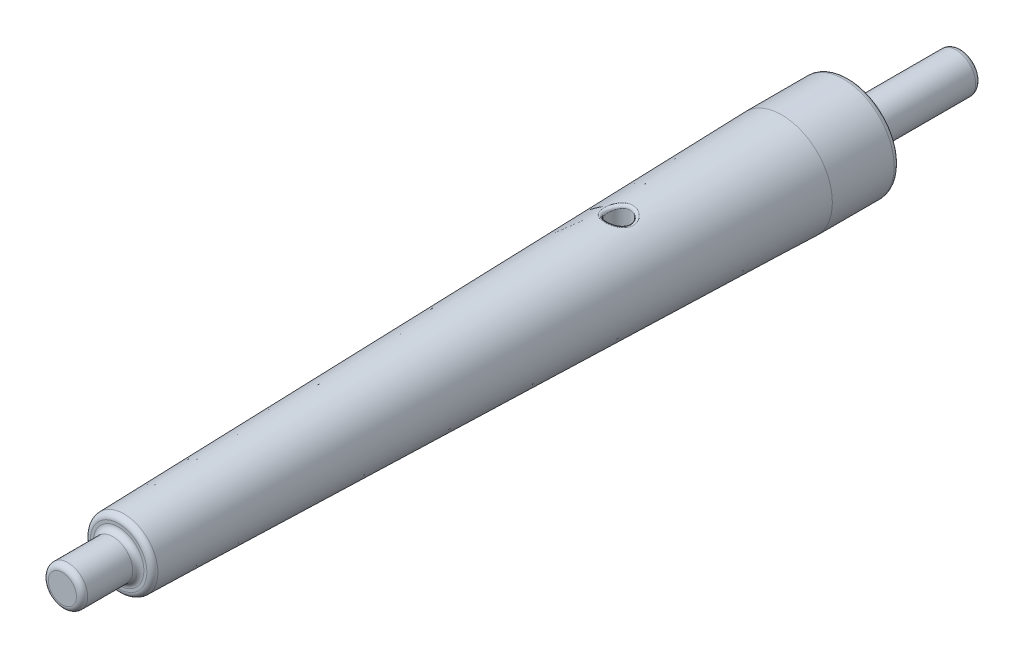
from build123d import *

# Parameters (mm, degrees)
SKETCH_2_R          = 1
CUT_EXTRUDE_1_DEPTH = 5
FILLET_1_R          = 0.5
FILLET_2_R          = 0.25


with BuildPart() as part:
    # Sketch 1 → Revolve 1 (revolve)
    with BuildSketch(Plane(origin=(0, 0, 0), x_dir=(0, 0, -1), z_dir=(1, 0, 0)), mode=Mode.PRIVATE) as revolve_1_sk:
        Polygon((-40, 0), (40, 0), (40, 1.75), (30, 1.75), (30, 4.5), (24, 4.5), (-35, 3), (-35, 1.75), (-40, 1.75), align=None)
    revolve(revolve_1_sk.sketch.rotate(Axis((0, 0, 40), (0, 0, -1)), 90), axis=Axis((0, 0, 40), (0, 0, -1)))

    # Sketch 2 → Cut-Extrude 1 (cut, symmetric)
    with BuildSketch(Plane(origin=(0, 0, 0), x_dir=(1, 0, 0), z_dir=(0, 1, 0))):
        with Locations(Location((0, 9.5, 0), (0, 0, 123.030689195))):
            Circle(SKETCH_2_R)
    extrude(amount=CUT_EXTRUDE_1_DEPTH, both=True, mode=Mode.SUBTRACT)

    # Fillet 1
    fillet_1_edges = [part.edges().sort_by_distance(p)[0] for p in [
        (-1.75, 0, 40),
        (-1.75, 0, -40),
        (-1.75, 0, -30),
        (-4.5, 0, -30),
        (-3, 0, 35),
        (-1.75, 0, 35),
    ]]
    fillet(fillet_1_edges, radius=FILLET_1_R)

    # Fillet 2
    fillet_2_edges = [part.edges().sort_by_distance(p)[0] for p in [
        (0.545618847, 4.073672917, -8.661966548),
        (0.545618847, -4.073672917, -8.661966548),
    ]]
    fillet(fillet_2_edges, radius=FILLET_2_R)


solid = part.part
